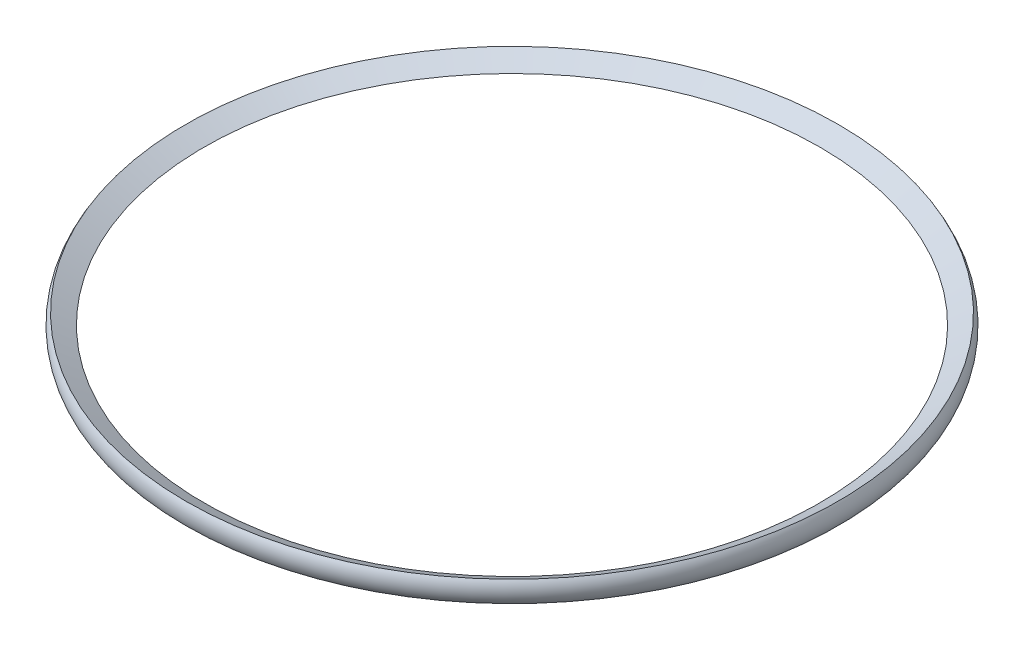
ISO-10303-21;
HEADER;
FILE_DESCRIPTION(('STEP AP214'),'2;1');
FILE_NAME('part.step','',(''),(''),'','','');
FILE_SCHEMA(('AUTOMOTIVE_DESIGN { 1 0 10303 214 1 1 1 1 }'));
ENDSEC;
DATA;
#1=APPLICATION_CONTEXT('core data for automotive mechanical design processes');
#2=APPLICATION_PROTOCOL_DEFINITION('international standard','automotive_design',2000,#1);
#3=PRODUCT_CONTEXT('',#1,'mechanical');
#4=PRODUCT('Part','Part','',(#3));
#5=PRODUCT_RELATED_PRODUCT_CATEGORY('part','',(#4));
#6=PRODUCT_DEFINITION_FORMATION('','',#4);
#7=PRODUCT_DEFINITION_CONTEXT('part definition',#1,'design');
#8=PRODUCT_DEFINITION('design','',#6,#7);
#9=PRODUCT_DEFINITION_SHAPE('','',#8);
#10=(LENGTH_UNIT() NAMED_UNIT(*) SI_UNIT(.MILLI.,.METRE.));
#11=(NAMED_UNIT(*) PLANE_ANGLE_UNIT() SI_UNIT($,.RADIAN.));
#12=(NAMED_UNIT(*) SI_UNIT($,.STERADIAN.) SOLID_ANGLE_UNIT());
#13=UNCERTAINTY_MEASURE_WITH_UNIT(LENGTH_MEASURE(1.E-05),#10,'distance_accuracy_value','');
#14=(GEOMETRIC_REPRESENTATION_CONTEXT(3) GLOBAL_UNCERTAINTY_ASSIGNED_CONTEXT((#13)) GLOBAL_UNIT_ASSIGNED_CONTEXT((#10,
#11,#12)) REPRESENTATION_CONTEXT('',''));
#15=CARTESIAN_POINT('',(0.,0.,0.));
#16=DIRECTION('',(0.,0.,1.));
#17=DIRECTION('',(1.,0.,0.));
#18=AXIS2_PLACEMENT_3D('',#15,#16,#17);
#19=CARTESIAN_POINT('',(0.,-3.40361012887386,0.));
#20=DIRECTION('',(0.,-1.,0.));
#21=DIRECTION('',(0.,0.,-1.));
#22=AXIS2_PLACEMENT_3D('',#19,#20,#21);
#23=CONICAL_SURFACE('',#22,109.5375,1.04719755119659);
#24=CARTESIAN_POINT('',(0.,0.145246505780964,0.));
#25=DIRECTION('',(0.,-1.,0.));
#26=DIRECTION('',(0.,0.,-1.));
#27=AXIS2_PLACEMENT_3D('',#24,#25,#26);
#28=CIRCLE('',#27,103.3907);
#29=CARTESIAN_POINT('',(0.,0.145246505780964,-103.3907));
#30=VERTEX_POINT('',#29);
#31=EDGE_CURVE('E10',#30,#30,#28,.T.);
#32=ORIENTED_EDGE('',*,*,#31,.F.);
#33=EDGE_LOOP('',(#32));
#34=FACE_BOUND('',#33,.T.);
#35=CARTESIAN_POINT('',(0.,-3.40361012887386,0.));
#36=DIRECTION('',(0.,-1.,0.));
#37=DIRECTION('',(0.,0.,-1.));
#38=AXIS2_PLACEMENT_3D('',#35,#36,#37);
#39=CIRCLE('',#38,109.5375);
#40=CARTESIAN_POINT('',(0.,-3.40361012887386,-109.5375));
#41=VERTEX_POINT('',#40);
#42=EDGE_CURVE('E48',#41,#41,#39,.T.);
#43=ORIENTED_EDGE('',*,*,#42,.T.);
#44=EDGE_LOOP('',(#43));
#45=FACE_BOUND('',#44,.T.);
#46=ADVANCED_FACE('F35',(#34,#45),#23,.F.);
#47=CARTESIAN_POINT('',(0.,0.145246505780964,0.));
#48=DIRECTION('',(0.,1.,0.));
#49=DIRECTION('',(0.,0.,1.));
#50=AXIS2_PLACEMENT_3D('',#47,#48,#49);
#51=CONICAL_SURFACE('',#50,103.3907,1.0471975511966);
#52=CARTESIAN_POINT('',(0.,3.69410314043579,0.));
#53=DIRECTION('',(0.,-1.,0.));
#54=DIRECTION('',(0.,0.,-1.));
#55=AXIS2_PLACEMENT_3D('',#52,#53,#54);
#56=CIRCLE('',#55,109.5375);
#57=CARTESIAN_POINT('',(0.,3.69410314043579,-109.5375));
#58=VERTEX_POINT('',#57);
#59=EDGE_CURVE('E42',#58,#58,#56,.T.);
#60=ORIENTED_EDGE('',*,*,#59,.F.);
#61=EDGE_LOOP('',(#60));
#62=FACE_BOUND('',#61,.T.);
#63=ORIENTED_EDGE('',*,*,#31,.T.);
#64=EDGE_LOOP('',(#63));
#65=FACE_BOUND('',#64,.T.);
#66=ADVANCED_FACE('F58',(#62,#65),#51,.F.);
#67=CARTESIAN_POINT('',(0.,0.14524650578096,0.));
#68=DIRECTION('',(0.,-1.,0.));
#69=DIRECTION('',(0.,0.,-1.));
#70=AXIS2_PLACEMENT_3D('',#67,#68,#69);
#71=TOROIDAL_SURFACE('',#70,104.271750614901,6.34999999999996);
#72=ORIENTED_EDGE('',*,*,#42,.F.);
#73=EDGE_LOOP('',(#72));
#74=FACE_BOUND('',#73,.T.);
#75=ORIENTED_EDGE('',*,*,#59,.T.);
#76=EDGE_LOOP('',(#75));
#77=FACE_BOUND('',#76,.T.);
#78=ADVANCED_FACE('F56',(#74,#77),#71,.T.);
#79=CLOSED_SHELL('',(#46,#66,#78));
#80=MANIFOLD_SOLID_BREP('B2',#79);
#81=ADVANCED_BREP_SHAPE_REPRESENTATION('',(#18,#80),#14);
#82=SHAPE_DEFINITION_REPRESENTATION(#9,#81);
ENDSEC;
END-ISO-10303-21;
